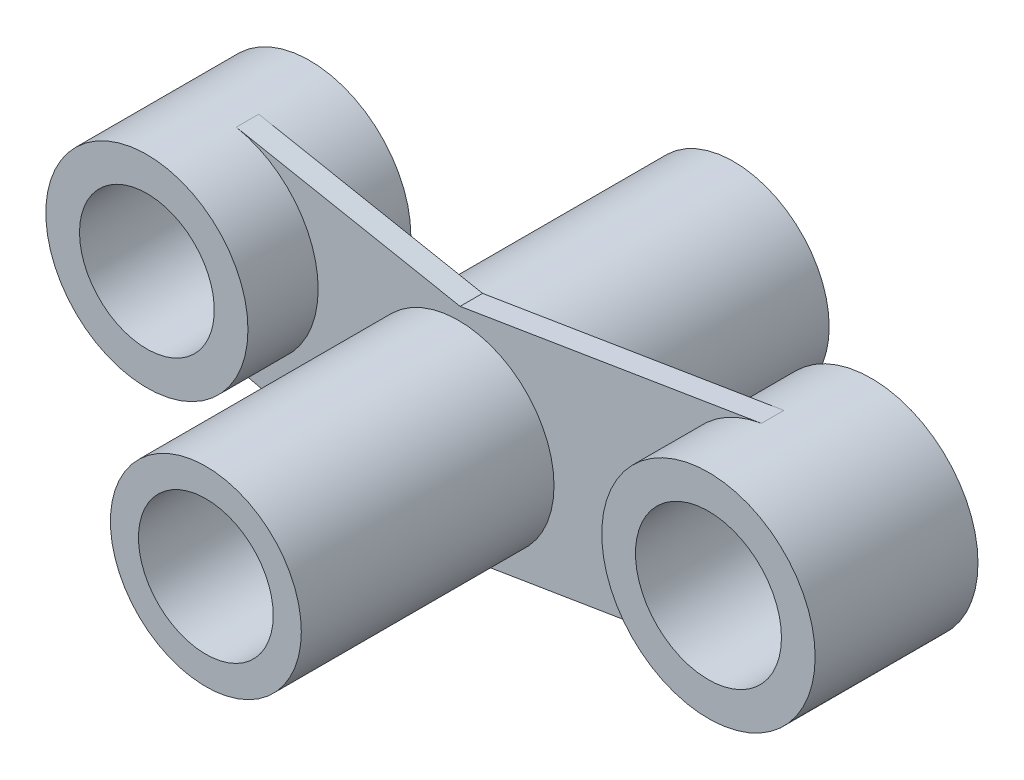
from build123d import *

# Parameters (mm, degrees)
ESQUISSE1_R      = 18
ESQUISSE1_R_2    = 12
EXTRUSION1_DEPTH = 14.5
ESQUISSE2_R      = 19
ESQUISSE2_R_2    = 13
EXTRUSION2_DEPTH = 14.5
ESQUISSE3_R      = 17
ESQUISSE3_R_2    = 12
EXTRUSION3_DEPTH = 47
ESQUISSE4_R      = 12
ESQUISSE4_R_2    = 13
EXTRUSION4_DEPTH = 2


with BuildPart() as part:
    # Esquisse1 → Extrusion1 (new, symmetric)
    with BuildSketch(Plane.XY):
        with Locations(Location((0, 0, 0), (0, 0, 180))):
            Circle(ESQUISSE1_R)
        with Locations(Location((0, 0, 0), (0, 0, 180))):
            Circle(ESQUISSE1_R_2, mode=Mode.SUBTRACT)
    extrude(amount=EXTRUSION1_DEPTH, both=True)



with BuildPart() as body_2:
    # Esquisse2 → Extrusion2 (new, symmetric)
    with BuildSketch(Plane.XY):
        with Locations(Location((100, 0, 0), (0, 0, 180))):
            Circle(ESQUISSE2_R)
        with Locations(Location((100, 0, 0), (0, 0, 180))):
            Circle(ESQUISSE2_R_2, mode=Mode.SUBTRACT)
    extrude(amount=EXTRUSION2_DEPTH, both=True)


with BuildPart() as body_3:
    # Esquisse3 → Extrusion3 (new, symmetric)
    with BuildSketch(Plane.XY):
        with Locations((43, -9.327379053)):
            Circle(ESQUISSE3_R)
        with Locations((43, -9.327379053)):
            Circle(ESQUISSE3_R_2, mode=Mode.SUBTRACT)
    extrude(amount=EXTRUSION3_DEPTH, both=True)


with BuildPart() as part_1:
    add(part.part)

    add(body_2.part)  # Extrusion4 merges body 2

    add(body_3.part)  # Extrusion4 merges body 3
    # Esquisse4 → Extrusion4 (add, symmetric)
    with BuildSketch(Plane.XY):
        with BuildLine():
            Line((38.551304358, -27.79922539), (-4.214553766, -17.499643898))
            ThreePointArc((-4.214553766, -17.499643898), (-17.590909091, 3.815745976), (3.414966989, 17.673086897))
            Line((3.414966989, 17.673086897), (43.276720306, 9.970608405))
            Line((43.276720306, 9.970608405), (96.931683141, 18.750611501))
            ThreePointArc((96.931683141, 18.750611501), (118.750611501, 3.068316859), (103.068316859, -18.750611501))
            Line((103.068316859, -18.750611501), (46.068316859, -28.077990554))
            ThreePointArc((46.068316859, -28.077990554), (42.295877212, -28.314327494), (38.551304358, -27.79922539))
        make_face()
        with Locations(Location((0, 0, 0), (0, 0, 180))):
            Circle(ESQUISSE4_R, mode=Mode.SUBTRACT)
        with Locations((43, -9.327379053)):
            Circle(ESQUISSE4_R, mode=Mode.SUBTRACT)
        with Locations((100, 0)):
            Circle(ESQUISSE4_R_2, mode=Mode.SUBTRACT)
    extrude(amount=EXTRUSION4_DEPTH, both=True)


solid = part_1.part
